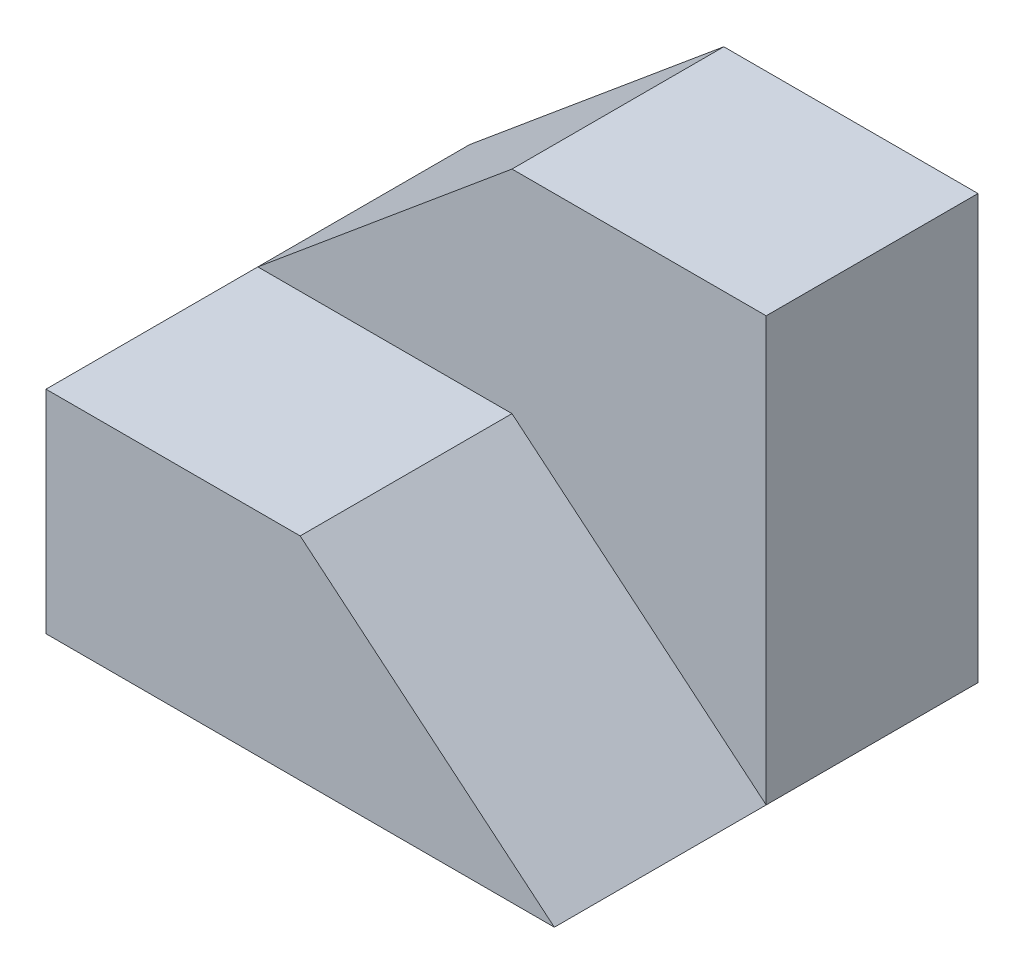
ISO-10303-21;
HEADER;
FILE_DESCRIPTION(('STEP AP214'),'2;1');
FILE_NAME('part.step','',(''),(''),'','','');
FILE_SCHEMA(('AUTOMOTIVE_DESIGN { 1 0 10303 214 1 1 1 1 }'));
ENDSEC;
DATA;
#1=APPLICATION_CONTEXT('core data for automotive mechanical design processes');
#2=APPLICATION_PROTOCOL_DEFINITION('international standard','automotive_design',2000,#1);
#3=PRODUCT_CONTEXT('',#1,'mechanical');
#4=PRODUCT('Part','Part','',(#3));
#5=PRODUCT_RELATED_PRODUCT_CATEGORY('part','',(#4));
#6=PRODUCT_DEFINITION_FORMATION('','',#4);
#7=PRODUCT_DEFINITION_CONTEXT('part definition',#1,'design');
#8=PRODUCT_DEFINITION('design','',#6,#7);
#9=PRODUCT_DEFINITION_SHAPE('','',#8);
#10=(LENGTH_UNIT() NAMED_UNIT(*) SI_UNIT(.MILLI.,.METRE.));
#11=(NAMED_UNIT(*) PLANE_ANGLE_UNIT() SI_UNIT($,.RADIAN.));
#12=(NAMED_UNIT(*) SI_UNIT($,.STERADIAN.) SOLID_ANGLE_UNIT());
#13=UNCERTAINTY_MEASURE_WITH_UNIT(LENGTH_MEASURE(1.E-05),#10,'distance_accuracy_value','');
#14=(GEOMETRIC_REPRESENTATION_CONTEXT(3) GLOBAL_UNCERTAINTY_ASSIGNED_CONTEXT((#13)) GLOBAL_UNIT_ASSIGNED_CONTEXT((#10,
#11,#12)) REPRESENTATION_CONTEXT('',''));
#15=CARTESIAN_POINT('',(0.,0.,0.));
#16=DIRECTION('',(0.,0.,1.));
#17=DIRECTION('',(1.,0.,0.));
#18=AXIS2_PLACEMENT_3D('',#15,#16,#17);
#19=CARTESIAN_POINT('',(-60.,0.,-100.));
#20=DIRECTION('',(-1.,0.,0.));
#21=DIRECTION('',(0.,0.,1.));
#22=AXIS2_PLACEMENT_3D('',#19,#20,#21);
#23=PLANE('',#22);
#24=DIRECTION('',(0.,-1.,0.));
#25=VECTOR('',#24,1.);
#26=CARTESIAN_POINT('',(-60.,0.,0.));
#27=LINE('',#26,#25);
#28=CARTESIAN_POINT('',(-60.,50.,0.));
#29=VERTEX_POINT('',#28);
#30=CARTESIAN_POINT('',(-60.,0.,0.));
#31=VERTEX_POINT('',#30);
#32=EDGE_CURVE('E124',#29,#31,#27,.T.);
#33=ORIENTED_EDGE('',*,*,#32,.F.);
#34=DIRECTION('',(0.,0.,1.));
#35=VECTOR('',#34,1.);
#36=CARTESIAN_POINT('',(-60.,50.,-100.));
#37=LINE('',#36,#35);
#38=CARTESIAN_POINT('',(-60.,50.,-50.));
#39=VERTEX_POINT('',#38);
#40=EDGE_CURVE('E39',#39,#29,#37,.T.);
#41=ORIENTED_EDGE('',*,*,#40,.F.);
#42=CARTESIAN_POINT('',(-60.,50.,-100.));
#43=VERTEX_POINT('',#42);
#44=EDGE_CURVE('E11',#43,#39,#37,.T.);
#45=ORIENTED_EDGE('',*,*,#44,.F.);
#46=DIRECTION('',(0.,-1.,0.));
#47=VECTOR('',#46,1.);
#48=CARTESIAN_POINT('',(-60.,0.,-100.));
#49=LINE('',#48,#47);
#50=CARTESIAN_POINT('',(-60.,0.,-100.));
#51=VERTEX_POINT('',#50);
#52=EDGE_CURVE('E126',#43,#51,#49,.T.);
#53=ORIENTED_EDGE('',*,*,#52,.T.);
#54=DIRECTION('',(0.,0.,1.));
#55=VECTOR('',#54,1.);
#56=CARTESIAN_POINT('',(-60.,0.,-100.));
#57=LINE('',#56,#55);
#58=EDGE_CURVE('E34',#51,#31,#57,.T.);
#59=ORIENTED_EDGE('',*,*,#58,.T.);
#60=EDGE_LOOP('',(#33,#41,#45,#53,#59));
#61=FACE_BOUND('',#60,.T.);
#62=ADVANCED_FACE('F31',(#61),#23,.T.);
#63=CARTESIAN_POINT('',(-60.,50.,-100.));
#64=DIRECTION('',(0.,1.,0.));
#65=DIRECTION('',(0.,0.,1.));
#66=AXIS2_PLACEMENT_3D('',#63,#64,#65);
#67=PLANE('',#66);
#68=DIRECTION('',(-1.,0.,0.));
#69=VECTOR('',#68,1.);
#70=CARTESIAN_POINT('',(-60.,50.,-50.));
#71=LINE('',#70,#69);
#72=CARTESIAN_POINT('',(0.,50.,-50.));
#73=VERTEX_POINT('',#72);
#74=EDGE_CURVE('E47',#73,#39,#71,.T.);
#75=ORIENTED_EDGE('',*,*,#74,.T.);
#76=ORIENTED_EDGE('',*,*,#40,.T.);
#77=DIRECTION('',(-1.,0.,0.));
#78=VECTOR('',#77,1.);
#79=CARTESIAN_POINT('',(-60.,50.,0.));
#80=LINE('',#79,#78);
#81=CARTESIAN_POINT('',(0.,50.,0.));
#82=VERTEX_POINT('',#81);
#83=EDGE_CURVE('E130',#82,#29,#80,.T.);
#84=ORIENTED_EDGE('',*,*,#83,.F.);
#85=DIRECTION('',(0.,0.,1.));
#86=VECTOR('',#85,1.);
#87=CARTESIAN_POINT('',(0.,50.,-100.));
#88=LINE('',#87,#86);
#89=EDGE_CURVE('E142',#73,#82,#88,.T.);
#90=ORIENTED_EDGE('',*,*,#89,.F.);
#91=EDGE_LOOP('',(#75,#76,#84,#90));
#92=FACE_BOUND('',#91,.T.);
#93=ADVANCED_FACE('F157',(#92),#67,.T.);
#94=CARTESIAN_POINT('',(0.,50.,-100.));
#95=DIRECTION('',(0.64018439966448,0.768221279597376,0.));
#96=DIRECTION('',(-0.768221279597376,0.64018439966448,0.));
#97=AXIS2_PLACEMENT_3D('',#94,#95,#96);
#98=PLANE('',#97);
#99=DIRECTION('',(-0.768221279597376,0.64018439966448,0.));
#100=VECTOR('',#99,1.);
#101=CARTESIAN_POINT('',(0.,50.,-50.));
#102=LINE('',#101,#100);
#103=CARTESIAN_POINT('',(60.,0.,-50.));
#104=VERTEX_POINT('',#103);
#105=EDGE_CURVE('E55',#104,#73,#102,.T.);
#106=ORIENTED_EDGE('',*,*,#105,.T.);
#107=ORIENTED_EDGE('',*,*,#89,.T.);
#108=DIRECTION('',(-0.768221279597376,0.64018439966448,0.));
#109=VECTOR('',#108,1.);
#110=CARTESIAN_POINT('',(0.,50.,0.));
#111=LINE('',#110,#109);
#112=CARTESIAN_POINT('',(60.,0.,0.));
#113=VERTEX_POINT('',#112);
#114=EDGE_CURVE('E137',#113,#82,#111,.T.);
#115=ORIENTED_EDGE('',*,*,#114,.F.);
#116=DIRECTION('',(0.,0.,1.));
#117=VECTOR('',#116,1.);
#118=CARTESIAN_POINT('',(60.,0.,-100.));
#119=LINE('',#118,#117);
#120=EDGE_CURVE('E145',#104,#113,#119,.T.);
#121=ORIENTED_EDGE('',*,*,#120,.F.);
#122=EDGE_LOOP('',(#106,#107,#115,#121));
#123=FACE_BOUND('',#122,.T.);
#124=ADVANCED_FACE('F176',(#123),#98,.T.);
#125=CARTESIAN_POINT('',(-60.,0.,-100.));
#126=DIRECTION('',(0.,-1.,0.));
#127=DIRECTION('',(0.,0.,-1.));
#128=AXIS2_PLACEMENT_3D('',#125,#126,#127);
#129=PLANE('',#128);
#130=DIRECTION('',(1.,0.,0.));
#131=VECTOR('',#130,1.);
#132=CARTESIAN_POINT('',(-60.,0.,0.));
#133=LINE('',#132,#131);
#134=EDGE_CURVE('E134',#31,#113,#133,.T.);
#135=ORIENTED_EDGE('',*,*,#134,.F.);
#136=ORIENTED_EDGE('',*,*,#58,.F.);
#137=DIRECTION('',(1.,0.,0.));
#138=VECTOR('',#137,1.);
#139=CARTESIAN_POINT('',(-60.,0.,-100.));
#140=LINE('',#139,#138);
#141=CARTESIAN_POINT('',(60.,0.,-100.));
#142=VERTEX_POINT('',#141);
#143=EDGE_CURVE('E129',#51,#142,#140,.T.);
#144=ORIENTED_EDGE('',*,*,#143,.T.);
#145=EDGE_CURVE('E143',#142,#104,#119,.T.);
#146=ORIENTED_EDGE('',*,*,#145,.T.);
#147=ORIENTED_EDGE('',*,*,#120,.T.);
#148=EDGE_LOOP('',(#135,#136,#144,#146,#147));
#149=FACE_BOUND('',#148,.T.);
#150=ADVANCED_FACE('F153',(#149),#129,.T.);
#151=CARTESIAN_POINT('',(-60.,50.,-100.));
#152=DIRECTION('',(0.,0.,-1.));
#153=DIRECTION('',(-1.,0.,0.));
#154=AXIS2_PLACEMENT_3D('',#151,#152,#153);
#155=PLANE('',#154);
#156=ORIENTED_EDGE('',*,*,#52,.F.);
#157=DIRECTION('',(0.768221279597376,0.64018439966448,0.));
#158=VECTOR('',#157,1.);
#159=CARTESIAN_POINT('',(-60.,50.,-100.));
#160=LINE('',#159,#158);
#161=CARTESIAN_POINT('',(0.,100.,-100.));
#162=VERTEX_POINT('',#161);
#163=EDGE_CURVE('E118',#43,#162,#160,.T.);
#164=ORIENTED_EDGE('',*,*,#163,.T.);
#165=DIRECTION('',(1.,0.,0.));
#166=VECTOR('',#165,1.);
#167=CARTESIAN_POINT('',(60.,100.,-100.));
#168=LINE('',#167,#166);
#169=CARTESIAN_POINT('',(60.,100.,-100.));
#170=VERTEX_POINT('',#169);
#171=EDGE_CURVE('E97',#162,#170,#168,.T.);
#172=ORIENTED_EDGE('',*,*,#171,.T.);
#173=DIRECTION('',(0.,-1.,0.));
#174=VECTOR('',#173,1.);
#175=CARTESIAN_POINT('',(60.,0.,-100.));
#176=LINE('',#175,#174);
#177=EDGE_CURVE('E121',#170,#142,#176,.T.);
#178=ORIENTED_EDGE('',*,*,#177,.T.);
#179=ORIENTED_EDGE('',*,*,#143,.F.);
#180=EDGE_LOOP('',(#156,#164,#172,#178,#179));
#181=FACE_BOUND('',#180,.T.);
#182=ADVANCED_FACE('F159',(#181),#155,.T.);
#183=CARTESIAN_POINT('',(-60.,50.,0.));
#184=DIRECTION('',(0.,0.,-1.));
#185=DIRECTION('',(-1.,0.,0.));
#186=AXIS2_PLACEMENT_3D('',#183,#184,#185);
#187=PLANE('',#186);
#188=ORIENTED_EDGE('',*,*,#32,.T.);
#189=ORIENTED_EDGE('',*,*,#134,.T.);
#190=ORIENTED_EDGE('',*,*,#114,.T.);
#191=ORIENTED_EDGE('',*,*,#83,.T.);
#192=EDGE_LOOP('',(#188,#189,#190,#191));
#193=FACE_BOUND('',#192,.T.);
#194=ADVANCED_FACE('F155',(#193),#187,.F.);
#195=CARTESIAN_POINT('',(60.,0.,-50.));
#196=DIRECTION('',(1.,0.,0.));
#197=DIRECTION('',(0.,0.,-1.));
#198=AXIS2_PLACEMENT_3D('',#195,#196,#197);
#199=PLANE('',#198);
#200=ORIENTED_EDGE('',*,*,#177,.F.);
#201=DIRECTION('',(0.,0.,-1.));
#202=VECTOR('',#201,1.);
#203=CARTESIAN_POINT('',(60.,100.,-50.));
#204=LINE('',#203,#202);
#205=CARTESIAN_POINT('',(60.,100.,-50.));
#206=VERTEX_POINT('',#205);
#207=EDGE_CURVE('E102',#206,#170,#204,.T.);
#208=ORIENTED_EDGE('',*,*,#207,.F.);
#209=DIRECTION('',(0.,-1.,0.));
#210=VECTOR('',#209,1.);
#211=CARTESIAN_POINT('',(60.,0.,-50.));
#212=LINE('',#211,#210);
#213=EDGE_CURVE('E103',#206,#104,#212,.T.);
#214=ORIENTED_EDGE('',*,*,#213,.T.);
#215=ORIENTED_EDGE('',*,*,#145,.F.);
#216=EDGE_LOOP('',(#200,#208,#214,#215));
#217=FACE_BOUND('',#216,.T.);
#218=ADVANCED_FACE('F162',(#217),#199,.T.);
#219=CARTESIAN_POINT('',(60.,100.,-50.));
#220=DIRECTION('',(0.,1.,0.));
#221=DIRECTION('',(0.,0.,1.));
#222=AXIS2_PLACEMENT_3D('',#219,#220,#221);
#223=PLANE('',#222);
#224=ORIENTED_EDGE('',*,*,#171,.F.);
#225=DIRECTION('',(0.,0.,-1.));
#226=VECTOR('',#225,1.);
#227=CARTESIAN_POINT('',(0.,100.,-50.));
#228=LINE('',#227,#226);
#229=CARTESIAN_POINT('',(0.,100.,-50.));
#230=VERTEX_POINT('',#229);
#231=EDGE_CURVE('E91',#230,#162,#228,.T.);
#232=ORIENTED_EDGE('',*,*,#231,.F.);
#233=DIRECTION('',(1.,0.,0.));
#234=VECTOR('',#233,1.);
#235=CARTESIAN_POINT('',(60.,100.,-50.));
#236=LINE('',#235,#234);
#237=EDGE_CURVE('E94',#230,#206,#236,.T.);
#238=ORIENTED_EDGE('',*,*,#237,.T.);
#239=ORIENTED_EDGE('',*,*,#207,.T.);
#240=EDGE_LOOP('',(#224,#232,#238,#239));
#241=FACE_BOUND('',#240,.T.);
#242=ADVANCED_FACE('F93',(#241),#223,.T.);
#243=CARTESIAN_POINT('',(-60.,50.,-50.));
#244=DIRECTION('',(-0.64018439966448,0.768221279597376,0.));
#245=DIRECTION('',(-0.768221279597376,-0.64018439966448,0.));
#246=AXIS2_PLACEMENT_3D('',#243,#244,#245);
#247=PLANE('',#246);
#248=ORIENTED_EDGE('',*,*,#163,.F.);
#249=ORIENTED_EDGE('',*,*,#44,.T.);
#250=DIRECTION('',(0.768221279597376,0.64018439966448,0.));
#251=VECTOR('',#250,1.);
#252=CARTESIAN_POINT('',(-60.,50.,-50.));
#253=LINE('',#252,#251);
#254=EDGE_CURVE('E108',#39,#230,#253,.T.);
#255=ORIENTED_EDGE('',*,*,#254,.T.);
#256=ORIENTED_EDGE('',*,*,#231,.T.);
#257=EDGE_LOOP('',(#248,#249,#255,#256));
#258=FACE_BOUND('',#257,.T.);
#259=ADVANCED_FACE('F111',(#258),#247,.T.);
#260=CARTESIAN_POINT('',(-30.,75.,-50.));
#261=DIRECTION('',(0.,0.,1.));
#262=DIRECTION('',(1.,0.,0.));
#263=AXIS2_PLACEMENT_3D('',#260,#261,#262);
#264=PLANE('',#263);
#265=ORIENTED_EDGE('',*,*,#105,.F.);
#266=ORIENTED_EDGE('',*,*,#213,.F.);
#267=ORIENTED_EDGE('',*,*,#237,.F.);
#268=ORIENTED_EDGE('',*,*,#254,.F.);
#269=ORIENTED_EDGE('',*,*,#74,.F.);
#270=EDGE_LOOP('',(#265,#266,#267,#268,#269));
#271=FACE_BOUND('',#270,.T.);
#272=ADVANCED_FACE('F107',(#271),#264,.T.);
#273=CLOSED_SHELL('',(#62,#93,#124,#150,#182,#194,#218,#242,#259,#272));
#274=MANIFOLD_SOLID_BREP('B2',#273);
#275=ADVANCED_BREP_SHAPE_REPRESENTATION('',(#18,#274),#14);
#276=SHAPE_DEFINITION_REPRESENTATION(#9,#275);
ENDSEC;
END-ISO-10303-21;
